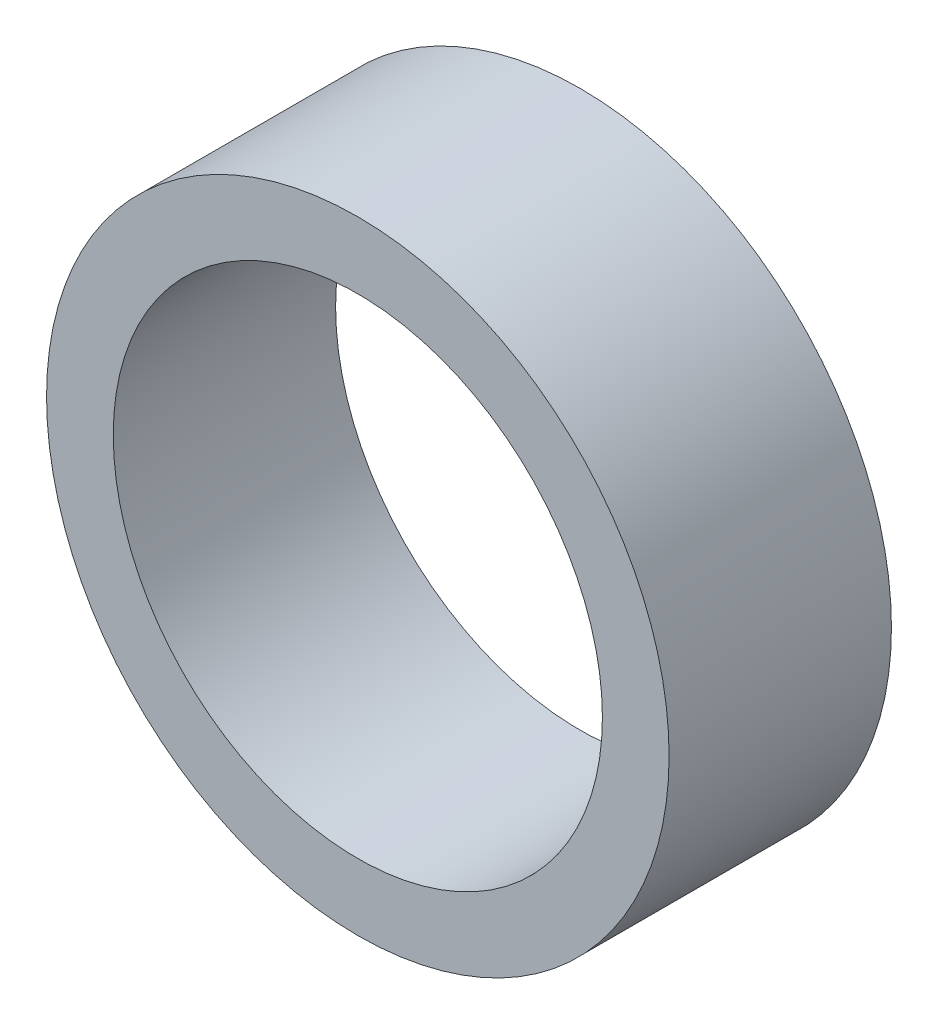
from build123d import *

# Parameters (mm, degrees)
SCHIZZO1_R                   = 7
ESTRUSIONE_ESTRUSIONE1_DEPTH = 5
SCHIZZO2_R                   = 5.5
TAGLIO_ESTRUSIONE1_DEPTH     = 35


with BuildPart() as part:
    # Schizzo1 → Estrusione-Estrusione1 (new body)
    with BuildSketch(Plane.XY):
        Circle(SCHIZZO1_R)
    extrude(amount=ESTRUSIONE_ESTRUSIONE1_DEPTH)

    # Schizzo2 → Taglio-Estrusione1 (cut)
    with BuildSketch(Plane.XY.offset(5)):
        Circle(SCHIZZO2_R)
    extrude(amount=-TAGLIO_ESTRUSIONE1_DEPTH, mode=Mode.SUBTRACT)


solid = part.part
